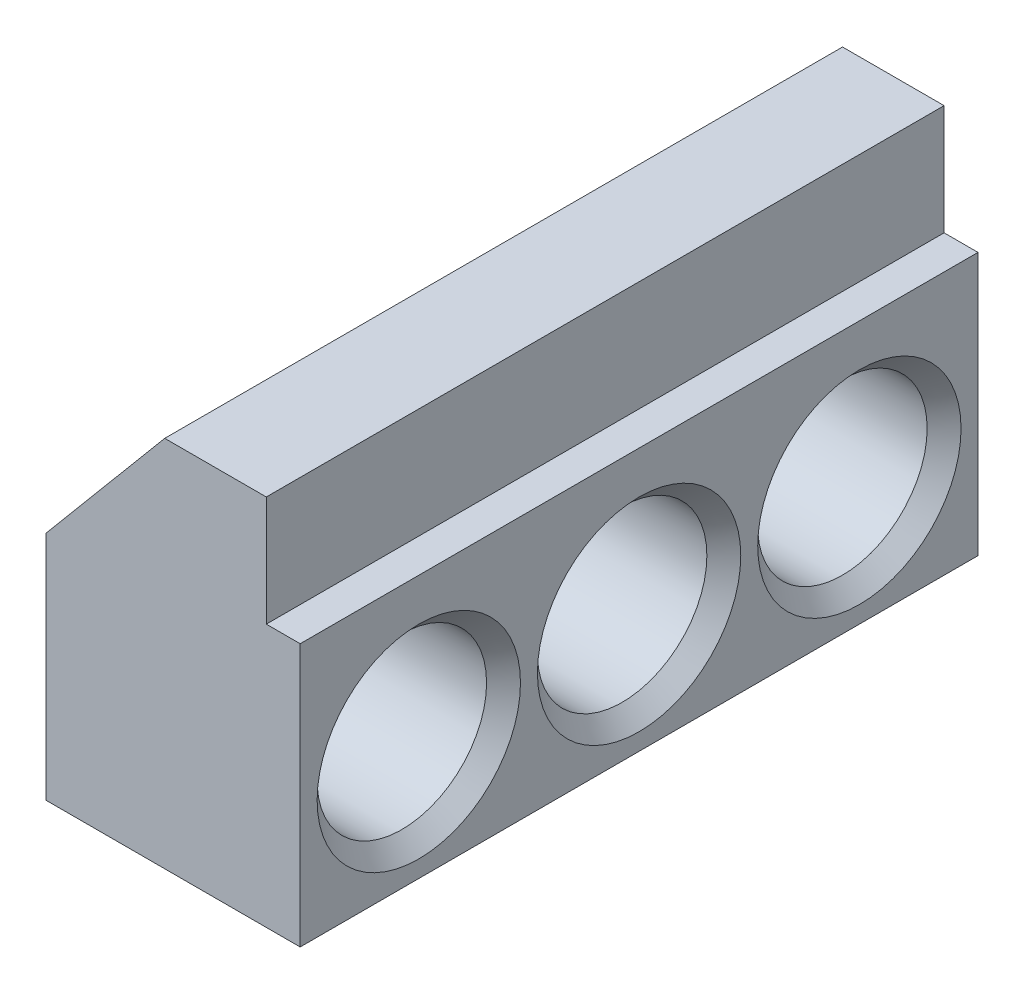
ISO-10303-21;
HEADER;
FILE_DESCRIPTION(('STEP AP214'),'2;1');
FILE_NAME('part.step','',(''),(''),'','','');
FILE_SCHEMA(('AUTOMOTIVE_DESIGN { 1 0 10303 214 1 1 1 1 }'));
ENDSEC;
DATA;
#1=APPLICATION_CONTEXT('core data for automotive mechanical design processes');
#2=APPLICATION_PROTOCOL_DEFINITION('international standard','automotive_design',2000,#1);
#3=PRODUCT_CONTEXT('',#1,'mechanical');
#4=PRODUCT('Part','Part','',(#3));
#5=PRODUCT_RELATED_PRODUCT_CATEGORY('part','',(#4));
#6=PRODUCT_DEFINITION_FORMATION('','',#4);
#7=PRODUCT_DEFINITION_CONTEXT('part definition',#1,'design');
#8=PRODUCT_DEFINITION('design','',#6,#7);
#9=PRODUCT_DEFINITION_SHAPE('','',#8);
#10=(LENGTH_UNIT() NAMED_UNIT(*) SI_UNIT(.MILLI.,.METRE.));
#11=(NAMED_UNIT(*) PLANE_ANGLE_UNIT() SI_UNIT($,.RADIAN.));
#12=(NAMED_UNIT(*) SI_UNIT($,.STERADIAN.) SOLID_ANGLE_UNIT());
#13=UNCERTAINTY_MEASURE_WITH_UNIT(LENGTH_MEASURE(1.E-05),#10,'distance_accuracy_value','');
#14=(GEOMETRIC_REPRESENTATION_CONTEXT(3) GLOBAL_UNCERTAINTY_ASSIGNED_CONTEXT((#13)) GLOBAL_UNIT_ASSIGNED_CONTEXT((#10,
#11,#12)) REPRESENTATION_CONTEXT('',''));
#15=CARTESIAN_POINT('',(0.,0.,0.));
#16=DIRECTION('',(0.,0.,1.));
#17=DIRECTION('',(1.,0.,0.));
#18=AXIS2_PLACEMENT_3D('',#15,#16,#17);
#19=CARTESIAN_POINT('',(0.,0.,-40.));
#20=DIRECTION('',(-1.,0.,0.));
#21=DIRECTION('',(0.,0.,1.));
#22=AXIS2_PLACEMENT_3D('',#19,#20,#21);
#23=PLANE('',#22);
#24=CARTESIAN_POINT('',(0.,6.99999999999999,-20.));
#25=DIRECTION('',(-1.,0.,0.));
#26=DIRECTION('',(0.,0.,1.));
#27=AXIS2_PLACEMENT_3D('',#24,#25,#26);
#28=CIRCLE('',#27,3.5);
#29=CARTESIAN_POINT('',(0.,6.99999999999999,-16.5));
#30=VERTEX_POINT('',#29);
#31=EDGE_CURVE('E36',#30,#30,#28,.F.);
#32=ORIENTED_EDGE('',*,*,#31,.T.);
#33=EDGE_LOOP('',(#32));
#34=FACE_BOUND('',#33,.T.);
#35=CARTESIAN_POINT('',(0.,7.,-6.99999999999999));
#36=DIRECTION('',(-1.,0.,0.));
#37=DIRECTION('',(0.,0.,1.));
#38=AXIS2_PLACEMENT_3D('',#35,#36,#37);
#39=CIRCLE('',#38,6.);
#40=CARTESIAN_POINT('',(0.,7.,-0.999999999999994));
#41=VERTEX_POINT('',#40);
#42=EDGE_CURVE('E152',#41,#41,#39,.F.);
#43=ORIENTED_EDGE('',*,*,#42,.T.);
#44=EDGE_LOOP('',(#43));
#45=FACE_BOUND('',#44,.T.);
#46=CARTESIAN_POINT('',(0.,6.99999999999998,-33.));
#47=DIRECTION('',(-1.,0.,0.));
#48=DIRECTION('',(0.,0.,1.));
#49=AXIS2_PLACEMENT_3D('',#46,#47,#48);
#50=CIRCLE('',#49,6.);
#51=CARTESIAN_POINT('',(0.,6.99999999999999,-27.));
#52=VERTEX_POINT('',#51);
#53=EDGE_CURVE('E143',#52,#52,#50,.F.);
#54=ORIENTED_EDGE('',*,*,#53,.T.);
#55=EDGE_LOOP('',(#54));
#56=FACE_BOUND('',#55,.T.);
#57=DIRECTION('',(0.,-1.,0.));
#58=VECTOR('',#57,1.);
#59=CARTESIAN_POINT('',(0.,0.,0.));
#60=LINE('',#59,#58);
#61=CARTESIAN_POINT('',(0.,13.65,0.));
#62=VERTEX_POINT('',#61);
#63=CARTESIAN_POINT('',(0.,0.,0.));
#64=VERTEX_POINT('',#63);
#65=EDGE_CURVE('E115',#62,#64,#60,.T.);
#66=ORIENTED_EDGE('',*,*,#65,.F.);
#67=DIRECTION('',(0.,0.,1.));
#68=VECTOR('',#67,1.);
#69=CARTESIAN_POINT('',(0.,13.65,-40.));
#70=LINE('',#69,#68);
#71=CARTESIAN_POINT('',(0.,13.65,-40.));
#72=VERTEX_POINT('',#71);
#73=EDGE_CURVE('E51',#72,#62,#70,.T.);
#74=ORIENTED_EDGE('',*,*,#73,.F.);
#75=DIRECTION('',(0.,-1.,0.));
#76=VECTOR('',#75,1.);
#77=CARTESIAN_POINT('',(0.,0.,-40.));
#78=LINE('',#77,#76);
#79=CARTESIAN_POINT('',(0.,0.,-40.));
#80=VERTEX_POINT('',#79);
#81=EDGE_CURVE('E128',#72,#80,#78,.T.);
#82=ORIENTED_EDGE('',*,*,#81,.T.);
#83=DIRECTION('',(0.,0.,1.));
#84=VECTOR('',#83,1.);
#85=CARTESIAN_POINT('',(0.,0.,-40.));
#86=LINE('',#85,#84);
#87=EDGE_CURVE('E141',#80,#64,#86,.T.);
#88=ORIENTED_EDGE('',*,*,#87,.T.);
#89=EDGE_LOOP('',(#66,#74,#82,#88));
#90=FACE_BOUND('',#89,.T.);
#91=ADVANCED_FACE('F29',(#34,#45,#56,#90),#23,.T.);
#92=CARTESIAN_POINT('',(7.00624721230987,22.,-40.));
#93=DIRECTION('',(-0.76605504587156,0.642774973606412,0.));
#94=DIRECTION('',(-0.642774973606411,-0.766055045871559,0.));
#95=AXIS2_PLACEMENT_3D('',#92,#93,#94);
#96=PLANE('',#95);
#97=DIRECTION('',(-0.642774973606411,-0.766055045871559,0.));
#98=VECTOR('',#97,1.);
#99=CARTESIAN_POINT('',(7.00624721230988,22.,0.));
#100=LINE('',#99,#98);
#101=CARTESIAN_POINT('',(7.00624721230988,22.,0.));
#102=VERTEX_POINT('',#101);
#103=EDGE_CURVE('E125',#102,#62,#100,.T.);
#104=ORIENTED_EDGE('',*,*,#103,.F.);
#105=DIRECTION('',(0.,0.,1.));
#106=VECTOR('',#105,1.);
#107=CARTESIAN_POINT('',(7.00624721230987,22.,-40.));
#108=LINE('',#107,#106);
#109=CARTESIAN_POINT('',(7.00624721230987,22.,-40.));
#110=VERTEX_POINT('',#109);
#111=EDGE_CURVE('E144',#110,#102,#108,.T.);
#112=ORIENTED_EDGE('',*,*,#111,.F.);
#113=DIRECTION('',(-0.642774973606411,-0.766055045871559,0.));
#114=VECTOR('',#113,1.);
#115=CARTESIAN_POINT('',(7.00624721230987,22.,-40.));
#116=LINE('',#115,#114);
#117=EDGE_CURVE('E138',#110,#72,#116,.T.);
#118=ORIENTED_EDGE('',*,*,#117,.T.);
#119=ORIENTED_EDGE('',*,*,#73,.T.);
#120=EDGE_LOOP('',(#104,#112,#118,#119));
#121=FACE_BOUND('',#120,.T.);
#122=ADVANCED_FACE('F196',(#121),#96,.T.);
#123=CARTESIAN_POINT('',(7.00624721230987,22.,-40.));
#124=DIRECTION('',(0.,1.,0.));
#125=DIRECTION('',(0.,0.,1.));
#126=AXIS2_PLACEMENT_3D('',#123,#124,#125);
#127=PLANE('',#126);
#128=DIRECTION('',(0.,0.,1.));
#129=VECTOR('',#128,1.);
#130=CARTESIAN_POINT('',(13.,22.,-40.));
#131=LINE('',#130,#129);
#132=CARTESIAN_POINT('',(13.,22.,-40.));
#133=VERTEX_POINT('',#132);
#134=CARTESIAN_POINT('',(13.,22.,0.));
#135=VERTEX_POINT('',#134);
#136=EDGE_CURVE('E43',#133,#135,#131,.T.);
#137=ORIENTED_EDGE('',*,*,#136,.F.);
#138=DIRECTION('',(-1.,0.,0.));
#139=VECTOR('',#138,1.);
#140=CARTESIAN_POINT('',(7.00624721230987,22.,-40.));
#141=LINE('',#140,#139);
#142=EDGE_CURVE('E136',#133,#110,#141,.T.);
#143=ORIENTED_EDGE('',*,*,#142,.T.);
#144=ORIENTED_EDGE('',*,*,#111,.T.);
#145=DIRECTION('',(-1.,0.,0.));
#146=VECTOR('',#145,1.);
#147=CARTESIAN_POINT('',(7.00624721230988,22.,0.));
#148=LINE('',#147,#146);
#149=EDGE_CURVE('E123',#135,#102,#148,.T.);
#150=ORIENTED_EDGE('',*,*,#149,.F.);
#151=EDGE_LOOP('',(#137,#143,#144,#150));
#152=FACE_BOUND('',#151,.T.);
#153=ADVANCED_FACE('F200',(#152),#127,.T.);
#154=CARTESIAN_POINT('',(15.,22.,-40.));
#155=DIRECTION('',(1.,0.,0.));
#156=DIRECTION('',(0.,1.,0.));
#157=AXIS2_PLACEMENT_3D('',#154,#155,#156);
#158=PLANE('',#157);
#159=CARTESIAN_POINT('',(15.,6.99999999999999,-20.));
#160=DIRECTION('',(1.,0.,0.));
#161=DIRECTION('',(0.,1.,0.));
#162=AXIS2_PLACEMENT_3D('',#159,#160,#161);
#163=CIRCLE('',#162,6.00000000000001);
#164=CARTESIAN_POINT('',(15.,13.,-20.));
#165=VERTEX_POINT('',#164);
#166=EDGE_CURVE('E176',#165,#165,#163,.F.);
#167=ORIENTED_EDGE('',*,*,#166,.T.);
#168=EDGE_LOOP('',(#167));
#169=FACE_BOUND('',#168,.T.);
#170=CARTESIAN_POINT('',(15.,6.99999999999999,-6.99999999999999));
#171=DIRECTION('',(1.,0.,0.));
#172=DIRECTION('',(0.,1.,0.));
#173=AXIS2_PLACEMENT_3D('',#170,#171,#172);
#174=CIRCLE('',#173,6.);
#175=CARTESIAN_POINT('',(15.,13.,-6.99999999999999));
#176=VERTEX_POINT('',#175);
#177=EDGE_CURVE('E170',#176,#176,#174,.F.);
#178=ORIENTED_EDGE('',*,*,#177,.T.);
#179=EDGE_LOOP('',(#178));
#180=FACE_BOUND('',#179,.T.);
#181=CARTESIAN_POINT('',(15.,6.99999999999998,-33.));
#182=DIRECTION('',(1.,0.,0.));
#183=DIRECTION('',(0.,1.,0.));
#184=AXIS2_PLACEMENT_3D('',#181,#182,#183);
#185=CIRCLE('',#184,6.00000000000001);
#186=CARTESIAN_POINT('',(15.,13.,-33.));
#187=VERTEX_POINT('',#186);
#188=EDGE_CURVE('E167',#187,#187,#185,.F.);
#189=ORIENTED_EDGE('',*,*,#188,.T.);
#190=EDGE_LOOP('',(#189));
#191=FACE_BOUND('',#190,.T.);
#192=DIRECTION('',(0.,0.,1.));
#193=VECTOR('',#192,1.);
#194=CARTESIAN_POINT('',(15.,15.5,-40.));
#195=LINE('',#194,#193);
#196=CARTESIAN_POINT('',(15.,15.5,-40.));
#197=VERTEX_POINT('',#196);
#198=CARTESIAN_POINT('',(15.,15.5,0.));
#199=VERTEX_POINT('',#198);
#200=EDGE_CURVE('E96',#197,#199,#195,.T.);
#201=ORIENTED_EDGE('',*,*,#200,.T.);
#202=DIRECTION('',(0.,1.,0.));
#203=VECTOR('',#202,1.);
#204=CARTESIAN_POINT('',(15.,22.,0.));
#205=LINE('',#204,#203);
#206=CARTESIAN_POINT('',(15.,0.,0.));
#207=VERTEX_POINT('',#206);
#208=EDGE_CURVE('E108',#207,#199,#205,.T.);
#209=ORIENTED_EDGE('',*,*,#208,.F.);
#210=DIRECTION('',(0.,0.,1.));
#211=VECTOR('',#210,1.);
#212=CARTESIAN_POINT('',(15.,0.,-40.));
#213=LINE('',#212,#211);
#214=CARTESIAN_POINT('',(15.,0.,-40.));
#215=VERTEX_POINT('',#214);
#216=EDGE_CURVE('E147',#215,#207,#213,.T.);
#217=ORIENTED_EDGE('',*,*,#216,.F.);
#218=DIRECTION('',(0.,1.,0.));
#219=VECTOR('',#218,1.);
#220=CARTESIAN_POINT('',(15.,22.,-40.));
#221=LINE('',#220,#219);
#222=EDGE_CURVE('E133',#215,#197,#221,.T.);
#223=ORIENTED_EDGE('',*,*,#222,.T.);
#224=EDGE_LOOP('',(#201,#209,#217,#223));
#225=FACE_BOUND('',#224,.T.);
#226=ADVANCED_FACE('F206',(#169,#180,#191,#225),#158,.T.);
#227=CARTESIAN_POINT('',(0.,0.,-40.));
#228=DIRECTION('',(0.,-1.,0.));
#229=DIRECTION('',(0.,0.,-1.));
#230=AXIS2_PLACEMENT_3D('',#227,#228,#229);
#231=PLANE('',#230);
#232=DIRECTION('',(1.,0.,0.));
#233=VECTOR('',#232,1.);
#234=CARTESIAN_POINT('',(0.,0.,0.));
#235=LINE('',#234,#233);
#236=EDGE_CURVE('E120',#64,#207,#235,.T.);
#237=ORIENTED_EDGE('',*,*,#236,.F.);
#238=ORIENTED_EDGE('',*,*,#87,.F.);
#239=DIRECTION('',(1.,0.,0.));
#240=VECTOR('',#239,1.);
#241=CARTESIAN_POINT('',(0.,0.,-40.));
#242=LINE('',#241,#240);
#243=EDGE_CURVE('E130',#80,#215,#242,.T.);
#244=ORIENTED_EDGE('',*,*,#243,.T.);
#245=ORIENTED_EDGE('',*,*,#216,.T.);
#246=EDGE_LOOP('',(#237,#238,#244,#245));
#247=FACE_BOUND('',#246,.T.);
#248=ADVANCED_FACE('F215',(#247),#231,.T.);
#249=CARTESIAN_POINT('',(0.,22.,-40.));
#250=DIRECTION('',(0.,0.,-1.));
#251=DIRECTION('',(-1.,0.,0.));
#252=AXIS2_PLACEMENT_3D('',#249,#250,#251);
#253=PLANE('',#252);
#254=DIRECTION('',(1.,0.,0.));
#255=VECTOR('',#254,1.);
#256=CARTESIAN_POINT('',(15.,15.5,-40.));
#257=LINE('',#256,#255);
#258=CARTESIAN_POINT('',(13.,15.5,-40.));
#259=VERTEX_POINT('',#258);
#260=EDGE_CURVE('E94',#259,#197,#257,.T.);
#261=ORIENTED_EDGE('',*,*,#260,.T.);
#262=ORIENTED_EDGE('',*,*,#222,.F.);
#263=ORIENTED_EDGE('',*,*,#243,.F.);
#264=ORIENTED_EDGE('',*,*,#81,.F.);
#265=ORIENTED_EDGE('',*,*,#117,.F.);
#266=ORIENTED_EDGE('',*,*,#142,.F.);
#267=DIRECTION('',(0.,-1.,0.));
#268=VECTOR('',#267,1.);
#269=CARTESIAN_POINT('',(13.,22.,-40.));
#270=LINE('',#269,#268);
#271=EDGE_CURVE('E109',#133,#259,#270,.T.);
#272=ORIENTED_EDGE('',*,*,#271,.T.);
#273=EDGE_LOOP('',(#261,#262,#263,#264,#265,#266,#272));
#274=FACE_BOUND('',#273,.T.);
#275=ADVANCED_FACE('F211',(#274),#253,.T.);
#276=CARTESIAN_POINT('',(0.,22.,0.));
#277=DIRECTION('',(0.,0.,-1.));
#278=DIRECTION('',(-1.,0.,0.));
#279=AXIS2_PLACEMENT_3D('',#276,#277,#278);
#280=PLANE('',#279);
#281=ORIENTED_EDGE('',*,*,#208,.T.);
#282=DIRECTION('',(1.,0.,0.));
#283=VECTOR('',#282,1.);
#284=CARTESIAN_POINT('',(15.,15.5,0.));
#285=LINE('',#284,#283);
#286=CARTESIAN_POINT('',(13.,15.5,0.));
#287=VERTEX_POINT('',#286);
#288=EDGE_CURVE('E91',#287,#199,#285,.T.);
#289=ORIENTED_EDGE('',*,*,#288,.F.);
#290=DIRECTION('',(0.,-1.,0.));
#291=VECTOR('',#290,1.);
#292=CARTESIAN_POINT('',(13.,22.,0.));
#293=LINE('',#292,#291);
#294=EDGE_CURVE('E98',#135,#287,#293,.T.);
#295=ORIENTED_EDGE('',*,*,#294,.F.);
#296=ORIENTED_EDGE('',*,*,#149,.T.);
#297=ORIENTED_EDGE('',*,*,#103,.T.);
#298=ORIENTED_EDGE('',*,*,#65,.T.);
#299=ORIENTED_EDGE('',*,*,#236,.T.);
#300=EDGE_LOOP('',(#281,#289,#295,#296,#297,#298,#299));
#301=FACE_BOUND('',#300,.T.);
#302=ADVANCED_FACE('F105',(#301),#280,.F.);
#303=CARTESIAN_POINT('',(15.,15.5,-40.));
#304=DIRECTION('',(0.,-1.,0.));
#305=DIRECTION('',(0.,0.,-1.));
#306=AXIS2_PLACEMENT_3D('',#303,#304,#305);
#307=PLANE('',#306);
#308=ORIENTED_EDGE('',*,*,#288,.T.);
#309=ORIENTED_EDGE('',*,*,#200,.F.);
#310=ORIENTED_EDGE('',*,*,#260,.F.);
#311=DIRECTION('',(0.,0.,1.));
#312=VECTOR('',#311,1.);
#313=CARTESIAN_POINT('',(13.,15.5,-40.));
#314=LINE('',#313,#312);
#315=EDGE_CURVE('E88',#259,#287,#314,.T.);
#316=ORIENTED_EDGE('',*,*,#315,.T.);
#317=EDGE_LOOP('',(#308,#309,#310,#316));
#318=FACE_BOUND('',#317,.T.);
#319=ADVANCED_FACE('F89',(#318),#307,.F.);
#320=CARTESIAN_POINT('',(13.,22.,-40.));
#321=DIRECTION('',(-1.,0.,0.));
#322=DIRECTION('',(0.,-1.,0.));
#323=AXIS2_PLACEMENT_3D('',#320,#321,#322);
#324=PLANE('',#323);
#325=ORIENTED_EDGE('',*,*,#294,.T.);
#326=ORIENTED_EDGE('',*,*,#315,.F.);
#327=ORIENTED_EDGE('',*,*,#271,.F.);
#328=ORIENTED_EDGE('',*,*,#136,.T.);
#329=EDGE_LOOP('',(#325,#326,#327,#328));
#330=FACE_BOUND('',#329,.T.);
#331=ADVANCED_FACE('F99',(#330),#324,.F.);
#332=CARTESIAN_POINT('',(0.,7.,-6.99999999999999));
#333=DIRECTION('',(1.,0.,0.));
#334=DIRECTION('',(0.,0.,-1.));
#335=AXIS2_PLACEMENT_3D('',#332,#333,#334);
#336=CYLINDRICAL_SURFACE('',#335,5.);
#337=CARTESIAN_POINT('',(1.,7.,-6.99999999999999));
#338=DIRECTION('',(-1.,0.,0.));
#339=DIRECTION('',(0.,0.,1.));
#340=AXIS2_PLACEMENT_3D('',#337,#338,#339);
#341=CIRCLE('',#340,5.);
#342=CARTESIAN_POINT('',(1.,7.,-1.99999999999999));
#343=VERTEX_POINT('',#342);
#344=EDGE_CURVE('E158',#343,#343,#341,.T.);
#345=ORIENTED_EDGE('',*,*,#344,.T.);
#346=EDGE_LOOP('',(#345));
#347=FACE_BOUND('',#346,.T.);
#348=CARTESIAN_POINT('',(14.,6.99999999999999,-6.99999999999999));
#349=DIRECTION('',(1.,0.,0.));
#350=DIRECTION('',(0.,0.,-1.));
#351=AXIS2_PLACEMENT_3D('',#348,#349,#350);
#352=CIRCLE('',#351,5.);
#353=CARTESIAN_POINT('',(14.,6.99999999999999,-12.));
#354=VERTEX_POINT('',#353);
#355=EDGE_CURVE('E155',#354,#354,#352,.T.);
#356=ORIENTED_EDGE('',*,*,#355,.T.);
#357=EDGE_LOOP('',(#356));
#358=FACE_BOUND('',#357,.T.);
#359=ADVANCED_FACE('F239',(#347,#358),#336,.F.);
#360=CARTESIAN_POINT('',(0.,6.99999999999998,-33.));
#361=DIRECTION('',(1.,0.,0.));
#362=DIRECTION('',(0.,0.,-1.));
#363=AXIS2_PLACEMENT_3D('',#360,#361,#362);
#364=CYLINDRICAL_SURFACE('',#363,5.);
#365=CARTESIAN_POINT('',(0.999999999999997,6.99999999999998,-33.));
#366=DIRECTION('',(-1.,0.,0.));
#367=DIRECTION('',(0.,0.,1.));
#368=AXIS2_PLACEMENT_3D('',#365,#366,#367);
#369=CIRCLE('',#368,5.);
#370=CARTESIAN_POINT('',(0.999999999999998,6.99999999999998,-28.));
#371=VERTEX_POINT('',#370);
#372=EDGE_CURVE('E164',#371,#371,#369,.T.);
#373=ORIENTED_EDGE('',*,*,#372,.T.);
#374=EDGE_LOOP('',(#373));
#375=FACE_BOUND('',#374,.T.);
#376=CARTESIAN_POINT('',(14.,6.99999999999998,-33.));
#377=DIRECTION('',(1.,0.,0.));
#378=DIRECTION('',(0.,0.,-1.));
#379=AXIS2_PLACEMENT_3D('',#376,#377,#378);
#380=CIRCLE('',#379,5.);
#381=CARTESIAN_POINT('',(14.,6.99999999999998,-38.));
#382=VERTEX_POINT('',#381);
#383=EDGE_CURVE('E161',#382,#382,#380,.T.);
#384=ORIENTED_EDGE('',*,*,#383,.T.);
#385=EDGE_LOOP('',(#384));
#386=FACE_BOUND('',#385,.T.);
#387=ADVANCED_FACE('F243',(#375,#386),#364,.F.);
#388=CARTESIAN_POINT('',(0.,7.,-6.99999999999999));
#389=DIRECTION('',(-1.,0.,0.));
#390=DIRECTION('',(0.,0.,1.));
#391=AXIS2_PLACEMENT_3D('',#388,#389,#390);
#392=CONICAL_SURFACE('',#391,6.,0.785398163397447);
#393=ORIENTED_EDGE('',*,*,#344,.F.);
#394=EDGE_LOOP('',(#393));
#395=FACE_BOUND('',#394,.T.);
#396=ORIENTED_EDGE('',*,*,#42,.F.);
#397=EDGE_LOOP('',(#396));
#398=FACE_BOUND('',#397,.T.);
#399=ADVANCED_FACE('F247',(#395,#398),#392,.F.);
#400=CARTESIAN_POINT('',(0.,6.99999999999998,-33.));
#401=DIRECTION('',(-1.,0.,0.));
#402=DIRECTION('',(0.,0.,1.));
#403=AXIS2_PLACEMENT_3D('',#400,#401,#402);
#404=CONICAL_SURFACE('',#403,6.,0.785398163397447);
#405=ORIENTED_EDGE('',*,*,#372,.F.);
#406=EDGE_LOOP('',(#405));
#407=FACE_BOUND('',#406,.T.);
#408=ORIENTED_EDGE('',*,*,#53,.F.);
#409=EDGE_LOOP('',(#408));
#410=FACE_BOUND('',#409,.T.);
#411=ADVANCED_FACE('F251',(#407,#410),#404,.F.);
#412=CARTESIAN_POINT('',(14.,6.99999999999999,-6.99999999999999));
#413=DIRECTION('',(1.,0.,0.));
#414=DIRECTION('',(0.,0.,-1.));
#415=AXIS2_PLACEMENT_3D('',#412,#413,#414);
#416=CONICAL_SURFACE('',#415,5.,0.78539816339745);
#417=ORIENTED_EDGE('',*,*,#177,.F.);
#418=EDGE_LOOP('',(#417));
#419=FACE_BOUND('',#418,.T.);
#420=ORIENTED_EDGE('',*,*,#355,.F.);
#421=EDGE_LOOP('',(#420));
#422=FACE_BOUND('',#421,.T.);
#423=ADVANCED_FACE('F255',(#419,#422),#416,.F.);
#424=CARTESIAN_POINT('',(14.,6.99999999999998,-33.));
#425=DIRECTION('',(1.,0.,0.));
#426=DIRECTION('',(0.,0.,-1.));
#427=AXIS2_PLACEMENT_3D('',#424,#425,#426);
#428=CONICAL_SURFACE('',#427,5.,0.785398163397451);
#429=ORIENTED_EDGE('',*,*,#188,.F.);
#430=EDGE_LOOP('',(#429));
#431=FACE_BOUND('',#430,.T.);
#432=ORIENTED_EDGE('',*,*,#383,.F.);
#433=EDGE_LOOP('',(#432));
#434=FACE_BOUND('',#433,.T.);
#435=ADVANCED_FACE('F259',(#431,#434),#428,.F.);
#436=CARTESIAN_POINT('',(3.99999999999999,6.99999999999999,-20.));
#437=DIRECTION('',(1.,0.,0.));
#438=DIRECTION('',(0.,1.,0.));
#439=AXIS2_PLACEMENT_3D('',#436,#437,#438);
#440=CYLINDRICAL_SURFACE('',#439,5.);
#441=CARTESIAN_POINT('',(14.,6.99999999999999,-20.));
#442=DIRECTION('',(1.,0.,0.));
#443=DIRECTION('',(0.,0.,-1.));
#444=AXIS2_PLACEMENT_3D('',#441,#442,#443);
#445=CIRCLE('',#444,5.);
#446=CARTESIAN_POINT('',(14.,6.99999999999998,-25.));
#447=VERTEX_POINT('',#446);
#448=EDGE_CURVE('E173',#447,#447,#445,.T.);
#449=ORIENTED_EDGE('',*,*,#448,.T.);
#450=EDGE_LOOP('',(#449));
#451=FACE_BOUND('',#450,.T.);
#452=CARTESIAN_POINT('',(3.99999999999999,6.99999999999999,-20.));
#453=DIRECTION('',(1.,0.,0.));
#454=DIRECTION('',(0.,1.,0.));
#455=AXIS2_PLACEMENT_3D('',#452,#453,#454);
#456=CIRCLE('',#455,5.);
#457=CARTESIAN_POINT('',(3.99999999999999,12.,-20.));
#458=VERTEX_POINT('',#457);
#459=EDGE_CURVE('E102',#458,#458,#456,.T.);
#460=ORIENTED_EDGE('',*,*,#459,.F.);
#461=EDGE_LOOP('',(#460));
#462=FACE_BOUND('',#461,.T.);
#463=ADVANCED_FACE('F263',(#451,#462),#440,.F.);
#464=CARTESIAN_POINT('',(3.99999999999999,6.99999999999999,-20.));
#465=DIRECTION('',(1.,0.,0.));
#466=DIRECTION('',(0.,1.,0.));
#467=AXIS2_PLACEMENT_3D('',#464,#465,#466);
#468=PLANE('',#467);
#469=CARTESIAN_POINT('',(3.99999999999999,6.99999999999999,-20.));
#470=DIRECTION('',(1.,0.,0.));
#471=DIRECTION('',(0.,1.,0.));
#472=AXIS2_PLACEMENT_3D('',#469,#470,#471);
#473=CIRCLE('',#472,3.);
#474=CARTESIAN_POINT('',(3.99999999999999,9.99999999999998,-20.));
#475=VERTEX_POINT('',#474);
#476=EDGE_CURVE('E283',#475,#475,#473,.T.);
#477=ORIENTED_EDGE('',*,*,#476,.F.);
#478=EDGE_LOOP('',(#477));
#479=FACE_BOUND('',#478,.T.);
#480=ORIENTED_EDGE('',*,*,#459,.T.);
#481=EDGE_LOOP('',(#480));
#482=FACE_BOUND('',#481,.T.);
#483=ADVANCED_FACE('F267',(#479,#482),#468,.T.);
#484=CARTESIAN_POINT('',(14.,6.99999999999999,-20.));
#485=DIRECTION('',(1.,0.,0.));
#486=DIRECTION('',(0.,0.,-1.));
#487=AXIS2_PLACEMENT_3D('',#484,#485,#486);
#488=CONICAL_SURFACE('',#487,5.,0.78539816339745);
#489=ORIENTED_EDGE('',*,*,#166,.F.);
#490=EDGE_LOOP('',(#489));
#491=FACE_BOUND('',#490,.T.);
#492=ORIENTED_EDGE('',*,*,#448,.F.);
#493=EDGE_LOOP('',(#492));
#494=FACE_BOUND('',#493,.T.);
#495=ADVANCED_FACE('F191',(#491,#494),#488,.F.);
#496=CARTESIAN_POINT('',(0.,6.99999999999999,-20.));
#497=DIRECTION('',(1.,0.,0.));
#498=DIRECTION('',(0.,1.,0.));
#499=AXIS2_PLACEMENT_3D('',#496,#497,#498);
#500=CYLINDRICAL_SURFACE('',#499,3.);
#501=CARTESIAN_POINT('',(0.499999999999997,6.99999999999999,-20.));
#502=DIRECTION('',(-1.,0.,0.));
#503=DIRECTION('',(0.,0.,1.));
#504=AXIS2_PLACEMENT_3D('',#501,#502,#503);
#505=CIRCLE('',#504,3.);
#506=CARTESIAN_POINT('',(0.499999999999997,6.99999999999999,-17.));
#507=VERTEX_POINT('',#506);
#508=EDGE_CURVE('E11',#507,#507,#505,.T.);
#509=ORIENTED_EDGE('',*,*,#508,.T.);
#510=EDGE_LOOP('',(#509));
#511=FACE_BOUND('',#510,.T.);
#512=ORIENTED_EDGE('',*,*,#476,.T.);
#513=EDGE_LOOP('',(#512));
#514=FACE_BOUND('',#513,.T.);
#515=ADVANCED_FACE('F185',(#511,#514),#500,.F.);
#516=CARTESIAN_POINT('',(0.,6.99999999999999,-20.));
#517=DIRECTION('',(-1.,0.,0.));
#518=DIRECTION('',(0.,0.,1.));
#519=AXIS2_PLACEMENT_3D('',#516,#517,#518);
#520=CONICAL_SURFACE('',#519,3.5,0.785398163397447);
#521=ORIENTED_EDGE('',*,*,#508,.F.);
#522=EDGE_LOOP('',(#521));
#523=FACE_BOUND('',#522,.T.);
#524=ORIENTED_EDGE('',*,*,#31,.F.);
#525=EDGE_LOOP('',(#524));
#526=FACE_BOUND('',#525,.T.);
#527=ADVANCED_FACE('F183',(#523,#526),#520,.F.);
#528=CLOSED_SHELL('',(#91,#122,#153,#226,#248,#275,#302,#319,#331,#359,#387,#399,#411,#423,#435,
#463,#483,#495,#515,#527));
#529=MANIFOLD_SOLID_BREP('B2',#528);
#530=ADVANCED_BREP_SHAPE_REPRESENTATION('',(#18,#529),#14);
#531=SHAPE_DEFINITION_REPRESENTATION(#9,#530);
ENDSEC;
END-ISO-10303-21;
